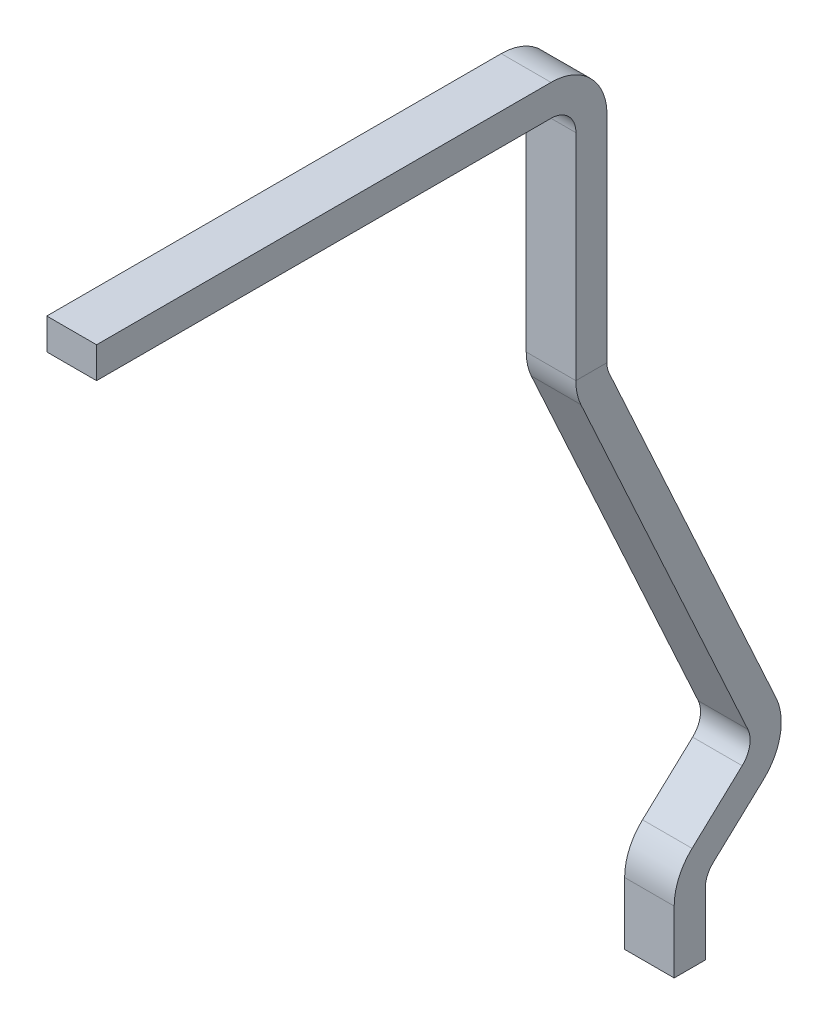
ISO-10303-21;
HEADER;
FILE_DESCRIPTION(('STEP AP214'),'2;1');
FILE_NAME('part.step','',(''),(''),'','','');
FILE_SCHEMA(('AUTOMOTIVE_DESIGN { 1 0 10303 214 1 1 1 1 }'));
ENDSEC;
DATA;
#1=APPLICATION_CONTEXT('core data for automotive mechanical design processes');
#2=APPLICATION_PROTOCOL_DEFINITION('international standard','automotive_design',2000,#1);
#3=PRODUCT_CONTEXT('',#1,'mechanical');
#4=PRODUCT('Part','Part','',(#3));
#5=PRODUCT_RELATED_PRODUCT_CATEGORY('part','',(#4));
#6=PRODUCT_DEFINITION_FORMATION('','',#4);
#7=PRODUCT_DEFINITION_CONTEXT('part definition',#1,'design');
#8=PRODUCT_DEFINITION('design','',#6,#7);
#9=PRODUCT_DEFINITION_SHAPE('','',#8);
#10=(LENGTH_UNIT() NAMED_UNIT(*) SI_UNIT(.MILLI.,.METRE.));
#11=(NAMED_UNIT(*) PLANE_ANGLE_UNIT() SI_UNIT($,.RADIAN.));
#12=(NAMED_UNIT(*) SI_UNIT($,.STERADIAN.) SOLID_ANGLE_UNIT());
#13=UNCERTAINTY_MEASURE_WITH_UNIT(LENGTH_MEASURE(1.E-05),#10,'distance_accuracy_value','');
#14=(GEOMETRIC_REPRESENTATION_CONTEXT(3) GLOBAL_UNCERTAINTY_ASSIGNED_CONTEXT((#13)) GLOBAL_UNIT_ASSIGNED_CONTEXT((#10,
#11,#12)) REPRESENTATION_CONTEXT('',''));
#15=CARTESIAN_POINT('',(0.,0.,0.));
#16=DIRECTION('',(0.,0.,1.));
#17=DIRECTION('',(1.,0.,0.));
#18=AXIS2_PLACEMENT_3D('',#15,#16,#17);
#19=CARTESIAN_POINT('',(0.20000000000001,-0.8625,-0.125));
#20=DIRECTION('',(1.,0.,0.));
#21=DIRECTION('',(0.,1.,0.));
#22=AXIS2_PLACEMENT_3D('',#19,#20,#21);
#23=PLANE('',#22);
#24=DIRECTION('',(0.,0.,1.));
#25=VECTOR('',#24,1.);
#26=CARTESIAN_POINT('',(0.2,1.0625,2.15));
#27=LINE('',#26,#25);
#28=CARTESIAN_POINT('',(0.200000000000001,1.06250000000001,0.325000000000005));
#29=VERTEX_POINT('',#28);
#30=CARTESIAN_POINT('',(0.2,1.0625,3.975));
#31=VERTEX_POINT('',#30);
#32=EDGE_CURVE('E223',#29,#31,#27,.T.);
#33=ORIENTED_EDGE('',*,*,#32,.F.);
#34=CARTESIAN_POINT('',(0.200000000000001,1.06250000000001,0.325));
#35=CARTESIAN_POINT('',(0.200000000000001,1.06183010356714,0.242036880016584));
#36=CARTESIAN_POINT('',(0.200000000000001,1.00392135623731,0.183578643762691));
#37=CARTESIAN_POINT('',(0.200000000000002,0.975421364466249,0.154808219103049));
#38=CARTESIAN_POINT('',(0.200000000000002,0.936118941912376,0.139042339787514));
#39=CARTESIAN_POINT('',(0.200000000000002,0.901906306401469,0.125318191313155));
#40=CARTESIAN_POINT('',(0.200000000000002,0.8625,0.125));
#41=B_SPLINE_CURVE_WITH_KNOTS('',2,(#34,#35,#36,#37,#38,#39,#40),.UNSPECIFIED.,.F.,.F.,(3,2,2,
3),(0.,0.5,0.75,1.),.UNSPECIFIED.);
#42=CARTESIAN_POINT('',(0.200000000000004,0.862499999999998,0.125000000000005));
#43=VERTEX_POINT('',#42);
#44=EDGE_CURVE('E232',#29,#43,#41,.T.);
#45=ORIENTED_EDGE('',*,*,#44,.T.);
#46=DIRECTION('',(0.,-1.,0.));
#47=VECTOR('',#46,1.);
#48=CARTESIAN_POINT('',(0.200000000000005,0.225,0.12500000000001));
#49=LINE('',#48,#47);
#50=CARTESIAN_POINT('',(0.199333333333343,-0.8625,0.125000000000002));
#51=VERTEX_POINT('',#50);
#52=EDGE_CURVE('E179',#43,#51,#49,.T.);
#53=ORIENTED_EDGE('',*,*,#52,.T.);
#54=CARTESIAN_POINT('',(0.20000000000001,-0.8625,0.125000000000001));
#55=DIRECTION('',(0.,0.,-1.));
#56=VECTOR('',#55,1.);
#57=LINE('',#54,#56);
#58=CARTESIAN_POINT('',(0.199333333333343,-0.8625,-0.125));
#59=VERTEX_POINT('',#58);
#60=EDGE_CURVE('E240',#51,#59,#57,.T.);
#61=ORIENTED_EDGE('',*,*,#60,.T.);
#62=DIRECTION('',(0.,-1.,0.));
#63=VECTOR('',#62,1.);
#64=CARTESIAN_POINT('',(0.20000000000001,0.,-0.125));
#65=LINE('',#64,#63);
#66=CARTESIAN_POINT('',(0.200000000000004,0.862499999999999,-0.125));
#67=VERTEX_POINT('',#66);
#68=EDGE_CURVE('E229',#67,#59,#65,.T.);
#69=ORIENTED_EDGE('',*,*,#68,.F.);
#70=CARTESIAN_POINT('',(0.200000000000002,0.8625,-0.125));
#71=CARTESIAN_POINT('',(0.200000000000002,0.904672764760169,-0.124659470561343));
#72=CARTESIAN_POINT('',(0.200000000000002,0.944383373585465,-0.117487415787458));
#73=CARTESIAN_POINT('',(0.200000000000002,0.985511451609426,-0.110059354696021));
#74=CARTESIAN_POINT('',(0.200000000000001,1.02814261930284,-0.0934047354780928));
#75=CARTESIAN_POINT('',(0.200000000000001,1.11301010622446,-0.0602497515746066));
#76=CARTESIAN_POINT('',(0.200000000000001,1.18069805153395,0.00680194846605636));
#77=CARTESIAN_POINT('',(0.2,1.24543150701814,0.070926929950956));
#78=CARTESIAN_POINT('',(0.2,1.28090473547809,0.159357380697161));
#79=CARTESIAN_POINT('',(0.2,1.3117840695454,0.236335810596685));
#80=CARTESIAN_POINT('',(0.2,1.3125,0.325));
#81=B_SPLINE_CURVE_WITH_KNOTS('',2,(#70,#71,#72,#73,#74,#75,#76,#77,#78,#79,#80),.UNSPECIFIED.,
.F.,.F.,(3,2,2,2,2,3),(0.,0.125,0.25,0.5,0.75,1.),.UNSPECIFIED.);
#82=CARTESIAN_POINT('',(0.200000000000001,1.3125,0.325000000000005));
#83=VERTEX_POINT('',#82);
#84=EDGE_CURVE('E281',#67,#83,#81,.T.);
#85=ORIENTED_EDGE('',*,*,#84,.T.);
#86=DIRECTION('',(0.,0.,-1.));
#87=VECTOR('',#86,1.);
#88=CARTESIAN_POINT('',(0.2,1.3125,2.15));
#89=LINE('',#88,#87);
#90=CARTESIAN_POINT('',(0.2,1.3125,3.975));
#91=VERTEX_POINT('',#90);
#92=EDGE_CURVE('E200',#91,#83,#89,.T.);
#93=ORIENTED_EDGE('',*,*,#92,.F.);
#94=DIRECTION('',(0.,1.,0.));
#95=VECTOR('',#94,1.);
#96=CARTESIAN_POINT('',(0.2,1.1875,3.975));
#97=LINE('',#96,#95);
#98=EDGE_CURVE('E216',#31,#91,#97,.T.);
#99=ORIENTED_EDGE('',*,*,#98,.F.);
#100=EDGE_LOOP('',(#33,#45,#53,#61,#69,#85,#93,#99));
#101=FACE_BOUND('',#100,.T.);
#102=ADVANCED_FACE('F17',(#101),#23,.T.);
#103=CARTESIAN_POINT('',(0.20000000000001,-0.8625,-0.125));
#104=DIRECTION('',(0.,0.,-1.));
#105=DIRECTION('',(-1.,0.,0.));
#106=AXIS2_PLACEMENT_3D('',#103,#104,#105);
#107=PLANE('',#106);
#108=DIRECTION('',(-1.,0.,0.));
#109=VECTOR('',#108,1.);
#110=CARTESIAN_POINT('',(0.,-0.8625,-0.125));
#111=LINE('',#110,#109);
#112=CARTESIAN_POINT('',(-0.19933333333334,-0.8625,-0.125));
#113=VERTEX_POINT('',#112);
#114=EDGE_CURVE('E226',#59,#113,#111,.T.);
#115=ORIENTED_EDGE('',*,*,#114,.T.);
#116=DIRECTION('',(0.,-1.,0.));
#117=VECTOR('',#116,1.);
#118=CARTESIAN_POINT('',(-0.2,0.225,-0.125));
#119=LINE('',#118,#117);
#120=CARTESIAN_POINT('',(-0.2,0.8625,-0.125));
#121=VERTEX_POINT('',#120);
#122=EDGE_CURVE('E220',#121,#113,#119,.T.);
#123=ORIENTED_EDGE('',*,*,#122,.F.);
#124=DIRECTION('',(-1.,0.,0.));
#125=VECTOR('',#124,1.);
#126=CARTESIAN_POINT('',(0.,0.8625,-0.125));
#127=LINE('',#126,#125);
#128=EDGE_CURVE('E192',#67,#121,#127,.T.);
#129=ORIENTED_EDGE('',*,*,#128,.F.);
#130=ORIENTED_EDGE('',*,*,#68,.T.);
#131=EDGE_LOOP('',(#115,#123,#129,#130));
#132=FACE_BOUND('',#131,.T.);
#133=ADVANCED_FACE('F266',(#132),#107,.T.);
#134=CARTESIAN_POINT('',(-0.2,1.0625,0.325));
#135=DIRECTION('',(0.,-1.,0.));
#136=DIRECTION('',(1.,0.,0.));
#137=AXIS2_PLACEMENT_3D('',#134,#135,#136);
#138=PLANE('',#137);
#139=DIRECTION('',(0.,0.,1.));
#140=VECTOR('',#139,1.);
#141=CARTESIAN_POINT('',(-0.2,1.06250000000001,1.925));
#142=LINE('',#141,#140);
#143=CARTESIAN_POINT('',(-0.2,1.06250000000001,0.325));
#144=VERTEX_POINT('',#143);
#145=CARTESIAN_POINT('',(-0.2,1.0625,3.975));
#146=VERTEX_POINT('',#145);
#147=EDGE_CURVE('E163',#144,#146,#142,.T.);
#148=ORIENTED_EDGE('',*,*,#147,.F.);
#149=DIRECTION('',(-1.,0.,0.));
#150=VECTOR('',#149,1.);
#151=CARTESIAN_POINT('',(0.,1.06250000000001,0.325));
#152=LINE('',#151,#150);
#153=EDGE_CURVE('E159',#29,#144,#152,.T.);
#154=ORIENTED_EDGE('',*,*,#153,.F.);
#155=ORIENTED_EDGE('',*,*,#32,.T.);
#156=DIRECTION('',(1.,0.,0.));
#157=VECTOR('',#156,1.);
#158=CARTESIAN_POINT('',(0.,1.0625,3.975));
#159=LINE('',#158,#157);
#160=EDGE_CURVE('E206',#146,#31,#159,.T.);
#161=ORIENTED_EDGE('',*,*,#160,.F.);
#162=EDGE_LOOP('',(#148,#154,#155,#161));
#163=FACE_BOUND('',#162,.T.);
#164=ADVANCED_FACE('F509',(#163),#138,.T.);
#165=CARTESIAN_POINT('',(-0.2,1.3125,3.975));
#166=DIRECTION('',(0.,0.,1.));
#167=DIRECTION('',(0.,-1.,0.));
#168=AXIS2_PLACEMENT_3D('',#165,#166,#167);
#169=PLANE('',#168);
#170=DIRECTION('',(0.,1.,0.));
#171=VECTOR('',#170,1.);
#172=CARTESIAN_POINT('',(-0.2,0.225,3.975));
#173=LINE('',#172,#171);
#174=CARTESIAN_POINT('',(-0.2,1.3125,3.975));
#175=VERTEX_POINT('',#174);
#176=EDGE_CURVE('E209',#146,#175,#173,.T.);
#177=ORIENTED_EDGE('',*,*,#176,.F.);
#178=ORIENTED_EDGE('',*,*,#160,.T.);
#179=ORIENTED_EDGE('',*,*,#98,.T.);
#180=DIRECTION('',(1.,0.,0.));
#181=VECTOR('',#180,1.);
#182=CARTESIAN_POINT('',(0.,1.3125,3.975));
#183=LINE('',#182,#181);
#184=EDGE_CURVE('E203',#175,#91,#183,.T.);
#185=ORIENTED_EDGE('',*,*,#184,.F.);
#186=EDGE_LOOP('',(#177,#178,#179,#185));
#187=FACE_BOUND('',#186,.T.);
#188=ADVANCED_FACE('F510',(#187),#169,.T.);
#189=CARTESIAN_POINT('',(0.2,1.3125,0.325));
#190=DIRECTION('',(0.,1.,0.));
#191=DIRECTION('',(-1.,0.,0.));
#192=AXIS2_PLACEMENT_3D('',#189,#190,#191);
#193=PLANE('',#192);
#194=ORIENTED_EDGE('',*,*,#92,.T.);
#195=DIRECTION('',(1.,0.,0.));
#196=VECTOR('',#195,1.);
#197=CARTESIAN_POINT('',(0.,1.3125,0.325));
#198=LINE('',#197,#196);
#199=CARTESIAN_POINT('',(-0.2,1.3125,0.325));
#200=VERTEX_POINT('',#199);
#201=EDGE_CURVE('E195',#200,#83,#198,.T.);
#202=ORIENTED_EDGE('',*,*,#201,.F.);
#203=DIRECTION('',(0.,0.,-1.));
#204=VECTOR('',#203,1.);
#205=CARTESIAN_POINT('',(-0.2,1.3125,1.925));
#206=LINE('',#205,#204);
#207=EDGE_CURVE('E183',#175,#200,#206,.T.);
#208=ORIENTED_EDGE('',*,*,#207,.F.);
#209=ORIENTED_EDGE('',*,*,#184,.T.);
#210=EDGE_LOOP('',(#194,#202,#208,#209));
#211=FACE_BOUND('',#210,.T.);
#212=ADVANCED_FACE('F307',(#211),#193,.T.);
#213=CARTESIAN_POINT('',(0.24,0.8625,0.325));
#214=DIRECTION('',(-1.,0.,0.));
#215=DIRECTION('',(0.,0.,1.));
#216=AXIS2_PLACEMENT_3D('',#213,#214,#215);
#217=CYLINDRICAL_SURFACE('',#216,0.45);
#218=ORIENTED_EDGE('',*,*,#84,.F.);
#219=ORIENTED_EDGE('',*,*,#128,.T.);
#220=CARTESIAN_POINT('',(-0.2,0.8625,0.325));
#221=DIRECTION('',(-1.,0.,0.));
#222=DIRECTION('',(0.,0.,1.));
#223=AXIS2_PLACEMENT_3D('',#220,#221,#222);
#224=CIRCLE('',#223,0.45);
#225=EDGE_CURVE('E180',#200,#121,#224,.T.);
#226=ORIENTED_EDGE('',*,*,#225,.F.);
#227=ORIENTED_EDGE('',*,*,#201,.T.);
#228=EDGE_LOOP('',(#218,#219,#226,#227));
#229=FACE_BOUND('',#228,.T.);
#230=ADVANCED_FACE('F297',(#229),#217,.T.);
#231=CARTESIAN_POINT('',(0.24,0.8625,0.325));
#232=DIRECTION('',(-1.,0.,0.));
#233=DIRECTION('',(0.,0.,1.));
#234=AXIS2_PLACEMENT_3D('',#231,#232,#233);
#235=CYLINDRICAL_SURFACE('',#234,0.200000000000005);
#236=CARTESIAN_POINT('',(-0.2,0.8625,0.325));
#237=DIRECTION('',(-1.,0.,0.));
#238=DIRECTION('',(0.,0.,1.));
#239=AXIS2_PLACEMENT_3D('',#236,#237,#238);
#240=CIRCLE('',#239,0.200000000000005);
#241=CARTESIAN_POINT('',(-0.200000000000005,0.8625,0.125));
#242=VERTEX_POINT('',#241);
#243=EDGE_CURVE('E21',#242,#144,#240,.F.);
#244=ORIENTED_EDGE('',*,*,#243,.F.);
#245=DIRECTION('',(-1.,0.,0.));
#246=VECTOR('',#245,1.);
#247=CARTESIAN_POINT('',(0.,0.8625,0.125));
#248=LINE('',#247,#246);
#249=EDGE_CURVE('E156',#43,#242,#248,.T.);
#250=ORIENTED_EDGE('',*,*,#249,.F.);
#251=ORIENTED_EDGE('',*,*,#44,.F.);
#252=ORIENTED_EDGE('',*,*,#153,.T.);
#253=EDGE_LOOP('',(#244,#250,#251,#252));
#254=FACE_BOUND('',#253,.T.);
#255=ADVANCED_FACE('F154',(#254),#235,.F.);
#256=CARTESIAN_POINT('',(-0.2,1.3125,-0.125));
#257=DIRECTION('',(-1.,0.,0.));
#258=DIRECTION('',(0.,-1.,0.));
#259=AXIS2_PLACEMENT_3D('',#256,#257,#258);
#260=PLANE('',#259);
#261=ORIENTED_EDGE('',*,*,#207,.T.);
#262=ORIENTED_EDGE('',*,*,#225,.T.);
#263=ORIENTED_EDGE('',*,*,#122,.T.);
#264=CARTESIAN_POINT('',(-0.2,-0.8625,-0.124999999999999));
#265=DIRECTION('',(0.,0.,1.));
#266=VECTOR('',#265,1.);
#267=LINE('',#264,#266);
#268=CARTESIAN_POINT('',(-0.19933333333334,-0.8625,0.125000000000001));
#269=VERTEX_POINT('',#268);
#270=EDGE_CURVE('E164',#113,#269,#267,.T.);
#271=ORIENTED_EDGE('',*,*,#270,.T.);
#272=DIRECTION('',(0.,-1.,0.));
#273=VECTOR('',#272,1.);
#274=CARTESIAN_POINT('',(-0.20000000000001,0.,0.125));
#275=LINE('',#274,#273);
#276=EDGE_CURVE('E167',#242,#269,#275,.T.);
#277=ORIENTED_EDGE('',*,*,#276,.F.);
#278=ORIENTED_EDGE('',*,*,#243,.T.);
#279=ORIENTED_EDGE('',*,*,#147,.T.);
#280=ORIENTED_EDGE('',*,*,#176,.T.);
#281=EDGE_LOOP('',(#261,#262,#263,#271,#277,#278,#279,#280));
#282=FACE_BOUND('',#281,.T.);
#283=ADVANCED_FACE('F169',(#282),#260,.T.);
#284=CARTESIAN_POINT('',(-0.20000000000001,-0.8625,0.125));
#285=DIRECTION('',(0.,0.,1.));
#286=DIRECTION('',(1.,0.,0.));
#287=AXIS2_PLACEMENT_3D('',#284,#285,#286);
#288=PLANE('',#287);
#289=DIRECTION('',(-1.,0.,0.));
#290=VECTOR('',#289,1.);
#291=CARTESIAN_POINT('',(0.,-0.8625,0.125));
#292=LINE('',#291,#290);
#293=EDGE_CURVE('E464',#51,#269,#292,.T.);
#294=ORIENTED_EDGE('',*,*,#293,.F.);
#295=ORIENTED_EDGE('',*,*,#52,.F.);
#296=ORIENTED_EDGE('',*,*,#249,.T.);
#297=ORIENTED_EDGE('',*,*,#276,.T.);
#298=EDGE_LOOP('',(#294,#295,#296,#297));
#299=FACE_BOUND('',#298,.T.);
#300=ADVANCED_FACE('F177',(#299),#288,.T.);
#301=CARTESIAN_POINT('',(-0.19900000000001,-0.8625,-1.5349));
#302=DIRECTION('',(-1.,0.,0.));
#303=DIRECTION('',(0.,-1.,0.));
#304=AXIS2_PLACEMENT_3D('',#301,#302,#303);
#305=PLANE('',#304);
#306=CARTESIAN_POINT('',(-0.199000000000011,-0.8625,-0.325000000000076));
#307=DIRECTION('',(1.,0.,0.));
#308=DIRECTION('',(0.,0.,-1.));
#309=AXIS2_PLACEMENT_3D('',#306,#307,#308);
#310=CIRCLE('',#309,0.45000000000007);
#311=CARTESIAN_POINT('',(-0.199000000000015,-1.04980458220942,0.0841662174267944));
#312=VERTEX_POINT('',#311);
#313=EDGE_CURVE('E461',#269,#312,#310,.T.);
#314=ORIENTED_EDGE('',*,*,#313,.F.);
#315=ORIENTED_EDGE('',*,*,#270,.F.);
#316=CARTESIAN_POINT('',(-0.199000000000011,-0.8625,-0.324999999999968));
#317=DIRECTION('',(1.,0.,0.));
#318=DIRECTION('',(0.,0.,-1.));
#319=AXIS2_PLACEMENT_3D('',#316,#317,#318);
#320=CIRCLE('',#319,0.199999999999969);
#321=CARTESIAN_POINT('',(-0.199000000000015,-0.945746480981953,-0.143148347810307));
#322=VERTEX_POINT('',#321);
#323=EDGE_CURVE('E465',#322,#113,#320,.F.);
#324=ORIENTED_EDGE('',*,*,#323,.F.);
#325=DIRECTION('',(0.,0.909258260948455,0.416232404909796));
#326=VECTOR('',#325,1.);
#327=CARTESIAN_POINT('',(-0.19900000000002,-2.41047094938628,-0.81365728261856));
#328=LINE('',#327,#326);
#329=CARTESIAN_POINT('',(-0.199000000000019,-3.87519541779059,-1.48416621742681));
#330=VERTEX_POINT('',#329);
#331=EDGE_CURVE('E445',#330,#322,#328,.T.);
#332=ORIENTED_EDGE('',*,*,#331,.F.);
#333=CARTESIAN_POINT('',(-0.199000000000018,-4.06250000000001,-1.075));
#334=DIRECTION('',(-1.,0.,0.));
#335=DIRECTION('',(0.,0.,1.));
#336=AXIS2_PLACEMENT_3D('',#333,#334,#335);
#337=CIRCLE('',#336,0.45);
#338=CARTESIAN_POINT('',(-0.199000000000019,-4.39220548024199,-1.38125854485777));
#339=VERTEX_POINT('',#338);
#340=EDGE_CURVE('E442',#339,#330,#337,.F.);
#341=ORIENTED_EDGE('',*,*,#340,.F.);
#342=DIRECTION('',(0.,0.68057454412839,-0.732678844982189));
#343=VECTOR('',#342,1.);
#344=CARTESIAN_POINT('',(-0.19900000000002,-4.57908485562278,-1.18007181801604));
#345=LINE('',#344,#343);
#346=CARTESIAN_POINT('',(-0.199000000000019,-4.76596423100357,-0.978885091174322));
#347=VERTEX_POINT('',#346);
#348=EDGE_CURVE('E450',#347,#339,#345,.T.);
#349=ORIENTED_EDGE('',*,*,#348,.F.);
#350=CARTESIAN_POINT('',(-0.199000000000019,-4.9125,-1.115));
#351=DIRECTION('',(1.,0.,0.));
#352=DIRECTION('',(0.,0.,-1.));
#353=AXIS2_PLACEMENT_3D('',#350,#351,#352);
#354=CIRCLE('',#353,0.199999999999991);
#355=CARTESIAN_POINT('',(-0.199000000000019,-4.9125,-0.915000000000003));
#356=VERTEX_POINT('',#355);
#357=EDGE_CURVE('E447',#356,#347,#354,.F.);
#358=ORIENTED_EDGE('',*,*,#357,.F.);
#359=DIRECTION('',(0.,-1.,0.));
#360=VECTOR('',#359,1.);
#361=CARTESIAN_POINT('',(-0.199000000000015,-3.1375,-0.915000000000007));
#362=LINE('',#361,#360);
#363=CARTESIAN_POINT('',(-0.19900000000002,-5.4125,-0.915000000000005));
#364=VERTEX_POINT('',#363);
#365=EDGE_CURVE('E175',#356,#364,#362,.T.);
#366=ORIENTED_EDGE('',*,*,#365,.T.);
#367=DIRECTION('',(0.,0.,1.));
#368=VECTOR('',#367,1.);
#369=CARTESIAN_POINT('',(-0.19900000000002,-5.4125,-0.7));
#370=LINE('',#369,#368);
#371=CARTESIAN_POINT('',(-0.19900000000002,-5.4125,-0.665000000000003));
#372=VERTEX_POINT('',#371);
#373=EDGE_CURVE('E473',#364,#372,#370,.T.);
#374=ORIENTED_EDGE('',*,*,#373,.T.);
#375=DIRECTION('',(0.,1.,0.));
#376=VECTOR('',#375,1.);
#377=CARTESIAN_POINT('',(-0.199000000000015,-3.1375,-0.665000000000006));
#378=LINE('',#377,#376);
#379=CARTESIAN_POINT('',(-0.199000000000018,-4.9125,-0.665000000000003));
#380=VERTEX_POINT('',#379);
#381=EDGE_CURVE('E469',#372,#380,#378,.T.);
#382=ORIENTED_EDGE('',*,*,#381,.T.);
#383=CARTESIAN_POINT('',(-0.199000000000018,-4.9125,-1.11499999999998));
#384=DIRECTION('',(1.,0.,0.));
#385=DIRECTION('',(0.,0.,-1.));
#386=AXIS2_PLACEMENT_3D('',#383,#384,#385);
#387=CIRCLE('',#386,0.449999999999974);
#388=CARTESIAN_POINT('',(-0.199000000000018,-4.58279451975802,-0.808741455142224));
#389=VERTEX_POINT('',#388);
#390=EDGE_CURVE('E452',#389,#380,#387,.T.);
#391=ORIENTED_EDGE('',*,*,#390,.F.);
#392=DIRECTION('',(0.,-0.680574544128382,0.732678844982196));
#393=VECTOR('',#392,1.);
#394=CARTESIAN_POINT('',(-0.19900000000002,-4.39591514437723,-1.00992818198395));
#395=LINE('',#394,#393);
#396=CARTESIAN_POINT('',(-0.199000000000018,-4.20903576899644,-1.21111490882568));
#397=VERTEX_POINT('',#396);
#398=EDGE_CURVE('E488',#397,#389,#395,.T.);
#399=ORIENTED_EDGE('',*,*,#398,.F.);
#400=CARTESIAN_POINT('',(-0.199000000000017,-4.06249999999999,-1.075));
#401=DIRECTION('',(-1.,0.,0.));
#402=DIRECTION('',(0.,0.,1.));
#403=AXIS2_PLACEMENT_3D('',#400,#401,#402);
#404=CIRCLE('',#403,0.200000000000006);
#405=CARTESIAN_POINT('',(-0.199000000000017,-3.97925351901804,-1.25685165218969));
#406=VERTEX_POINT('',#405);
#407=EDGE_CURVE('E456',#406,#397,#404,.T.);
#408=ORIENTED_EDGE('',*,*,#407,.F.);
#409=DIRECTION('',(0.,-0.909258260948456,-0.416232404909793));
#410=VECTOR('',#409,1.);
#411=CARTESIAN_POINT('',(-0.19900000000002,-2.51452905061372,-0.586342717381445));
#412=LINE('',#411,#410);
#413=EDGE_CURVE('E491',#312,#406,#412,.T.);
#414=ORIENTED_EDGE('',*,*,#413,.F.);
#415=EDGE_LOOP('',(#314,#315,#324,#332,#341,#349,#358,#366,#374,#382,#391,#399,#408,#414));
#416=FACE_BOUND('',#415,.T.);
#417=ADVANCED_FACE('F339',(#416),#305,.T.);
#418=CARTESIAN_POINT('',(-0.238800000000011,-0.8625,-0.324999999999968));
#419=DIRECTION('',(1.,0.,0.));
#420=DIRECTION('',(0.,0.,-1.));
#421=AXIS2_PLACEMENT_3D('',#418,#419,#420);
#422=CYLINDRICAL_SURFACE('',#421,0.199999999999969);
#423=CARTESIAN_POINT('',(0.199000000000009,-0.8625,-0.324999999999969));
#424=DIRECTION('',(1.,0.,0.));
#425=DIRECTION('',(0.,0.,-1.));
#426=AXIS2_PLACEMENT_3D('',#423,#424,#425);
#427=CIRCLE('',#426,0.199999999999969);
#428=CARTESIAN_POINT('',(0.19900000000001,-0.945746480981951,-0.143148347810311));
#429=VERTEX_POINT('',#428);
#430=EDGE_CURVE('E435',#429,#59,#427,.F.);
#431=ORIENTED_EDGE('',*,*,#430,.F.);
#432=DIRECTION('',(1.,0.,0.));
#433=VECTOR('',#432,1.);
#434=CARTESIAN_POINT('',(0.,-0.94574648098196,-0.14314834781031));
#435=LINE('',#434,#433);
#436=EDGE_CURVE('E551',#322,#429,#435,.T.);
#437=ORIENTED_EDGE('',*,*,#436,.F.);
#438=ORIENTED_EDGE('',*,*,#323,.T.);
#439=ORIENTED_EDGE('',*,*,#114,.F.);
#440=EDGE_LOOP('',(#431,#437,#438,#439));
#441=FACE_BOUND('',#440,.T.);
#442=ADVANCED_FACE('F348',(#441),#422,.F.);
#443=CARTESIAN_POINT('',(-0.238800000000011,-0.8625,-0.325000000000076));
#444=DIRECTION('',(1.,0.,0.));
#445=DIRECTION('',(0.,0.,-1.));
#446=AXIS2_PLACEMENT_3D('',#443,#444,#445);
#447=CYLINDRICAL_SURFACE('',#446,0.45000000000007);
#448=CARTESIAN_POINT('',(0.19900000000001,-0.8625,-0.325000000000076));
#449=DIRECTION('',(1.,0.,0.));
#450=DIRECTION('',(0.,0.,-1.));
#451=AXIS2_PLACEMENT_3D('',#448,#449,#450);
#452=CIRCLE('',#451,0.45000000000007);
#453=CARTESIAN_POINT('',(0.199000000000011,-1.04980458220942,0.0841662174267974));
#454=VERTEX_POINT('',#453);
#455=EDGE_CURVE('E432',#51,#454,#452,.T.);
#456=ORIENTED_EDGE('',*,*,#455,.F.);
#457=ORIENTED_EDGE('',*,*,#293,.T.);
#458=ORIENTED_EDGE('',*,*,#313,.T.);
#459=DIRECTION('',(-1.,0.,0.));
#460=VECTOR('',#459,1.);
#461=CARTESIAN_POINT('',(0.,-1.04980458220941,0.0841662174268));
#462=LINE('',#461,#460);
#463=EDGE_CURVE('E460',#454,#312,#462,.T.);
#464=ORIENTED_EDGE('',*,*,#463,.F.);
#465=EDGE_LOOP('',(#456,#457,#458,#464));
#466=FACE_BOUND('',#465,.T.);
#467=ADVANCED_FACE('F351',(#466),#447,.T.);
#468=CARTESIAN_POINT('',(-0.19900000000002,-1.04980458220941,0.0841662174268));
#469=DIRECTION('',(0.,-0.416232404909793,0.909258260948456));
#470=DIRECTION('',(0.,-0.909258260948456,-0.416232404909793));
#471=AXIS2_PLACEMENT_3D('',#468,#469,#470);
#472=PLANE('',#471);
#473=DIRECTION('',(0.,-0.909258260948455,-0.416232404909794));
#474=VECTOR('',#473,1.);
#475=CARTESIAN_POINT('',(0.19900000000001,-1.04980458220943,0.0841662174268));
#476=LINE('',#475,#474);
#477=CARTESIAN_POINT('',(0.199000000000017,-3.97925351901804,-1.25685165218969));
#478=VERTEX_POINT('',#477);
#479=EDGE_CURVE('E429',#454,#478,#476,.T.);
#480=ORIENTED_EDGE('',*,*,#479,.F.);
#481=ORIENTED_EDGE('',*,*,#463,.T.);
#482=ORIENTED_EDGE('',*,*,#413,.T.);
#483=DIRECTION('',(-1.,0.,0.));
#484=VECTOR('',#483,1.);
#485=CARTESIAN_POINT('',(0.,-3.97925351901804,-1.2568516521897));
#486=LINE('',#485,#484);
#487=EDGE_CURVE('E459',#478,#406,#486,.T.);
#488=ORIENTED_EDGE('',*,*,#487,.F.);
#489=EDGE_LOOP('',(#480,#481,#482,#488));
#490=FACE_BOUND('',#489,.T.);
#491=ADVANCED_FACE('F355',(#490),#472,.T.);
#492=CARTESIAN_POINT('',(0.23880000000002,-4.06249999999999,-1.075));
#493=DIRECTION('',(-1.,0.,0.));
#494=DIRECTION('',(0.,0.,1.));
#495=AXIS2_PLACEMENT_3D('',#492,#493,#494);
#496=CYLINDRICAL_SURFACE('',#495,0.200000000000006);
#497=CARTESIAN_POINT('',(0.199000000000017,-4.06249999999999,-1.075));
#498=DIRECTION('',(-1.,0.,0.));
#499=DIRECTION('',(0.,0.,1.));
#500=AXIS2_PLACEMENT_3D('',#497,#498,#499);
#501=CIRCLE('',#500,0.200000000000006);
#502=CARTESIAN_POINT('',(0.199000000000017,-4.20903576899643,-1.21111490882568));
#503=VERTEX_POINT('',#502);
#504=EDGE_CURVE('E426',#478,#503,#501,.T.);
#505=ORIENTED_EDGE('',*,*,#504,.F.);
#506=ORIENTED_EDGE('',*,*,#487,.T.);
#507=ORIENTED_EDGE('',*,*,#407,.T.);
#508=DIRECTION('',(-1.,0.,0.));
#509=VECTOR('',#508,1.);
#510=CARTESIAN_POINT('',(0.,-4.20903576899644,-1.21111490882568));
#511=LINE('',#510,#509);
#512=EDGE_CURVE('E455',#503,#397,#511,.T.);
#513=ORIENTED_EDGE('',*,*,#512,.F.);
#514=EDGE_LOOP('',(#505,#506,#507,#513));
#515=FACE_BOUND('',#514,.T.);
#516=ADVANCED_FACE('F359',(#515),#496,.F.);
#517=CARTESIAN_POINT('',(-0.19900000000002,-4.20903576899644,-1.21111490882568));
#518=DIRECTION('',(0.,0.732678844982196,0.680574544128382));
#519=DIRECTION('',(0.,-0.680574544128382,0.732678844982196));
#520=AXIS2_PLACEMENT_3D('',#517,#518,#519);
#521=PLANE('',#520);
#522=DIRECTION('',(0.,-0.680574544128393,0.732678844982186));
#523=VECTOR('',#522,1.);
#524=CARTESIAN_POINT('',(0.199000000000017,-4.20903576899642,-1.21111490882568));
#525=LINE('',#524,#523);
#526=CARTESIAN_POINT('',(0.199000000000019,-4.58279451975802,-0.808741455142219));
#527=VERTEX_POINT('',#526);
#528=EDGE_CURVE('E423',#503,#527,#525,.T.);
#529=ORIENTED_EDGE('',*,*,#528,.F.);
#530=ORIENTED_EDGE('',*,*,#512,.T.);
#531=ORIENTED_EDGE('',*,*,#398,.T.);
#532=DIRECTION('',(-1.,0.,0.));
#533=VECTOR('',#532,1.);
#534=CARTESIAN_POINT('',(0.,-4.58279451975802,-0.80874145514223));
#535=LINE('',#534,#533);
#536=EDGE_CURVE('E451',#527,#389,#535,.T.);
#537=ORIENTED_EDGE('',*,*,#536,.F.);
#538=EDGE_LOOP('',(#529,#530,#531,#537));
#539=FACE_BOUND('',#538,.T.);
#540=ADVANCED_FACE('F363',(#539),#521,.T.);
#541=CARTESIAN_POINT('',(-0.23880000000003,-4.9125,-1.11499999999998));
#542=DIRECTION('',(1.,0.,0.));
#543=DIRECTION('',(0.,0.,-1.));
#544=AXIS2_PLACEMENT_3D('',#541,#542,#543);
#545=CYLINDRICAL_SURFACE('',#544,0.449999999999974);
#546=CARTESIAN_POINT('',(0.199000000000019,-4.9125,-1.11499999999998));
#547=DIRECTION('',(1.,0.,0.));
#548=DIRECTION('',(0.,0.,-1.));
#549=AXIS2_PLACEMENT_3D('',#546,#547,#548);
#550=CIRCLE('',#549,0.449999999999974);
#551=CARTESIAN_POINT('',(0.199000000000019,-4.9125,-0.665000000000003));
#552=VERTEX_POINT('',#551);
#553=EDGE_CURVE('E419',#527,#552,#550,.T.);
#554=ORIENTED_EDGE('',*,*,#553,.F.);
#555=ORIENTED_EDGE('',*,*,#536,.T.);
#556=ORIENTED_EDGE('',*,*,#390,.T.);
#557=DIRECTION('',(-1.,0.,0.));
#558=VECTOR('',#557,1.);
#559=CARTESIAN_POINT('',(0.,-4.9125,-0.665));
#560=LINE('',#559,#558);
#561=EDGE_CURVE('E530',#552,#380,#560,.T.);
#562=ORIENTED_EDGE('',*,*,#561,.F.);
#563=EDGE_LOOP('',(#554,#555,#556,#562));
#564=FACE_BOUND('',#563,.T.);
#565=ADVANCED_FACE('F367',(#564),#545,.T.);
#566=CARTESIAN_POINT('',(-0.23880000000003,-4.9125,-1.115));
#567=DIRECTION('',(1.,0.,0.));
#568=DIRECTION('',(0.,0.,-1.));
#569=AXIS2_PLACEMENT_3D('',#566,#567,#568);
#570=CYLINDRICAL_SURFACE('',#569,0.199999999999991);
#571=CARTESIAN_POINT('',(0.199000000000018,-4.9125,-1.115));
#572=DIRECTION('',(1.,0.,0.));
#573=DIRECTION('',(0.,0.,-1.));
#574=AXIS2_PLACEMENT_3D('',#571,#572,#573);
#575=CIRCLE('',#574,0.199999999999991);
#576=CARTESIAN_POINT('',(0.199000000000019,-4.9125,-0.915000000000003));
#577=VERTEX_POINT('',#576);
#578=CARTESIAN_POINT('',(0.199000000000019,-4.76596423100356,-0.978885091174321));
#579=VERTEX_POINT('',#578);
#580=EDGE_CURVE('E416',#577,#579,#575,.F.);
#581=ORIENTED_EDGE('',*,*,#580,.F.);
#582=DIRECTION('',(1.,0.,0.));
#583=VECTOR('',#582,1.);
#584=CARTESIAN_POINT('',(0.,-4.9125,-0.915));
#585=LINE('',#584,#583);
#586=EDGE_CURVE('E439',#356,#577,#585,.T.);
#587=ORIENTED_EDGE('',*,*,#586,.F.);
#588=ORIENTED_EDGE('',*,*,#357,.T.);
#589=DIRECTION('',(-1.,0.,0.));
#590=VECTOR('',#589,1.);
#591=CARTESIAN_POINT('',(0.,-4.76596423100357,-0.97888509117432));
#592=LINE('',#591,#590);
#593=EDGE_CURVE('E487',#579,#347,#592,.T.);
#594=ORIENTED_EDGE('',*,*,#593,.F.);
#595=EDGE_LOOP('',(#581,#587,#588,#594));
#596=FACE_BOUND('',#595,.T.);
#597=ADVANCED_FACE('F371',(#596),#570,.F.);
#598=CARTESIAN_POINT('',(-0.19900000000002,-4.76596423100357,-0.97888509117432));
#599=DIRECTION('',(0.,-0.732678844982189,-0.68057454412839));
#600=DIRECTION('',(0.,0.68057454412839,-0.732678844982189));
#601=AXIS2_PLACEMENT_3D('',#598,#599,#600);
#602=PLANE('',#601);
#603=DIRECTION('',(0.,0.680574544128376,-0.732678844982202));
#604=VECTOR('',#603,1.);
#605=CARTESIAN_POINT('',(0.199000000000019,-4.76596423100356,-0.978885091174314));
#606=LINE('',#605,#604);
#607=CARTESIAN_POINT('',(0.199000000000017,-4.39220548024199,-1.38125854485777));
#608=VERTEX_POINT('',#607);
#609=EDGE_CURVE('E413',#579,#608,#606,.T.);
#610=ORIENTED_EDGE('',*,*,#609,.F.);
#611=ORIENTED_EDGE('',*,*,#593,.T.);
#612=ORIENTED_EDGE('',*,*,#348,.T.);
#613=DIRECTION('',(-1.,0.,0.));
#614=VECTOR('',#613,1.);
#615=CARTESIAN_POINT('',(0.,-4.39220548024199,-1.38125854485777));
#616=LINE('',#615,#614);
#617=EDGE_CURVE('E446',#608,#339,#616,.T.);
#618=ORIENTED_EDGE('',*,*,#617,.F.);
#619=EDGE_LOOP('',(#610,#611,#612,#618));
#620=FACE_BOUND('',#619,.T.);
#621=ADVANCED_FACE('F375',(#620),#602,.T.);
#622=CARTESIAN_POINT('',(0.23880000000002,-4.06250000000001,-1.075));
#623=DIRECTION('',(-1.,0.,0.));
#624=DIRECTION('',(0.,0.,1.));
#625=AXIS2_PLACEMENT_3D('',#622,#623,#624);
#626=CYLINDRICAL_SURFACE('',#625,0.45);
#627=DIRECTION('',(-1.,0.,0.));
#628=VECTOR('',#627,1.);
#629=CARTESIAN_POINT('',(0.,-3.87519541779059,-1.48416621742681));
#630=LINE('',#629,#628);
#631=CARTESIAN_POINT('',(0.199000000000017,-3.8751954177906,-1.48416621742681));
#632=VERTEX_POINT('',#631);
#633=EDGE_CURVE('E532',#632,#330,#630,.T.);
#634=ORIENTED_EDGE('',*,*,#633,.F.);
#635=CARTESIAN_POINT('',(0.199000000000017,-4.06250000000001,-1.075));
#636=DIRECTION('',(-1.,0.,0.));
#637=DIRECTION('',(0.,0.,1.));
#638=AXIS2_PLACEMENT_3D('',#635,#636,#637);
#639=CIRCLE('',#638,0.45);
#640=EDGE_CURVE('E410',#608,#632,#639,.F.);
#641=ORIENTED_EDGE('',*,*,#640,.F.);
#642=ORIENTED_EDGE('',*,*,#617,.T.);
#643=ORIENTED_EDGE('',*,*,#340,.T.);
#644=EDGE_LOOP('',(#634,#641,#642,#643));
#645=FACE_BOUND('',#644,.T.);
#646=ADVANCED_FACE('F379',(#645),#626,.T.);
#647=CARTESIAN_POINT('',(-0.19900000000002,-3.87519541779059,-1.48416621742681));
#648=DIRECTION('',(0.,0.416232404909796,-0.909258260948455));
#649=DIRECTION('',(0.,0.909258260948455,0.416232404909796));
#650=AXIS2_PLACEMENT_3D('',#647,#648,#649);
#651=PLANE('',#650);
#652=DIRECTION('',(0.,0.909258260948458,0.416232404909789));
#653=VECTOR('',#652,1.);
#654=CARTESIAN_POINT('',(0.199000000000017,-3.8751954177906,-1.4841662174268));
#655=LINE('',#654,#653);
#656=EDGE_CURVE('E401',#632,#429,#655,.T.);
#657=ORIENTED_EDGE('',*,*,#656,.F.);
#658=ORIENTED_EDGE('',*,*,#633,.T.);
#659=ORIENTED_EDGE('',*,*,#331,.T.);
#660=ORIENTED_EDGE('',*,*,#436,.T.);
#661=EDGE_LOOP('',(#657,#658,#659,#660));
#662=FACE_BOUND('',#661,.T.);
#663=ADVANCED_FACE('F383',(#662),#651,.T.);
#664=CARTESIAN_POINT('',(-0.19900000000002,-5.4125,-0.665));
#665=DIRECTION('',(0.,0.,1.));
#666=DIRECTION('',(1.,0.,0.));
#667=AXIS2_PLACEMENT_3D('',#664,#665,#666);
#668=PLANE('',#667);
#669=DIRECTION('',(0.,-1.,0.));
#670=VECTOR('',#669,1.);
#671=CARTESIAN_POINT('',(0.199000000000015,-3.1375,-0.665000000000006));
#672=LINE('',#671,#670);
#673=CARTESIAN_POINT('',(0.19900000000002,-5.4125,-0.665000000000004));
#674=VERTEX_POINT('',#673);
#675=EDGE_CURVE('E422',#552,#674,#672,.T.);
#676=ORIENTED_EDGE('',*,*,#675,.F.);
#677=ORIENTED_EDGE('',*,*,#561,.T.);
#678=ORIENTED_EDGE('',*,*,#381,.F.);
#679=DIRECTION('',(-1.,0.,0.));
#680=VECTOR('',#679,1.);
#681=CARTESIAN_POINT('',(0.,-5.4125,-0.665));
#682=LINE('',#681,#680);
#683=EDGE_CURVE('E409',#674,#372,#682,.T.);
#684=ORIENTED_EDGE('',*,*,#683,.F.);
#685=EDGE_LOOP('',(#676,#677,#678,#684));
#686=FACE_BOUND('',#685,.T.);
#687=ADVANCED_FACE('F387',(#686),#668,.T.);
#688=CARTESIAN_POINT('',(0.19900000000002,-5.4125,-0.915));
#689=DIRECTION('',(0.,0.,-1.));
#690=DIRECTION('',(-1.,0.,0.));
#691=AXIS2_PLACEMENT_3D('',#688,#689,#690);
#692=PLANE('',#691);
#693=DIRECTION('',(0.,1.,0.));
#694=VECTOR('',#693,1.);
#695=CARTESIAN_POINT('',(0.199000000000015,-3.1375,-0.915000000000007));
#696=LINE('',#695,#694);
#697=CARTESIAN_POINT('',(0.19900000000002,-5.4125,-0.915000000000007));
#698=VERTEX_POINT('',#697);
#699=EDGE_CURVE('E36',#698,#577,#696,.T.);
#700=ORIENTED_EDGE('',*,*,#699,.F.);
#701=DIRECTION('',(1.,0.,0.));
#702=VECTOR('',#701,1.);
#703=CARTESIAN_POINT('',(0.,-5.4125,-0.915));
#704=LINE('',#703,#702);
#705=EDGE_CURVE('E27',#364,#698,#704,.T.);
#706=ORIENTED_EDGE('',*,*,#705,.F.);
#707=ORIENTED_EDGE('',*,*,#365,.F.);
#708=ORIENTED_EDGE('',*,*,#586,.T.);
#709=EDGE_LOOP('',(#700,#706,#707,#708));
#710=FACE_BOUND('',#709,.T.);
#711=ADVANCED_FACE('F391',(#710),#692,.T.);
#712=CARTESIAN_POINT('',(0.19900000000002,-5.4125,-1.5349));
#713=DIRECTION('',(1.,0.,0.));
#714=DIRECTION('',(0.,1.,0.));
#715=AXIS2_PLACEMENT_3D('',#712,#713,#714);
#716=PLANE('',#715);
#717=ORIENTED_EDGE('',*,*,#640,.T.);
#718=ORIENTED_EDGE('',*,*,#656,.T.);
#719=ORIENTED_EDGE('',*,*,#430,.T.);
#720=ORIENTED_EDGE('',*,*,#60,.F.);
#721=ORIENTED_EDGE('',*,*,#455,.T.);
#722=ORIENTED_EDGE('',*,*,#479,.T.);
#723=ORIENTED_EDGE('',*,*,#504,.T.);
#724=ORIENTED_EDGE('',*,*,#528,.T.);
#725=ORIENTED_EDGE('',*,*,#553,.T.);
#726=ORIENTED_EDGE('',*,*,#675,.T.);
#727=DIRECTION('',(0.,0.,1.));
#728=VECTOR('',#727,1.);
#729=CARTESIAN_POINT('',(0.19900000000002,-5.4125,-0.79));
#730=LINE('',#729,#728);
#731=EDGE_CURVE('E11',#698,#674,#730,.T.);
#732=ORIENTED_EDGE('',*,*,#731,.F.);
#733=ORIENTED_EDGE('',*,*,#699,.T.);
#734=ORIENTED_EDGE('',*,*,#580,.T.);
#735=ORIENTED_EDGE('',*,*,#609,.T.);
#736=EDGE_LOOP('',(#717,#718,#719,#720,#721,#722,#723,#724,#725,#726,#732,#733,#734,#735));
#737=FACE_BOUND('',#736,.T.);
#738=ADVANCED_FACE('F394',(#737),#716,.T.);
#739=CARTESIAN_POINT('',(-0.19900000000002,-5.4125,-0.665));
#740=DIRECTION('',(0.,-1.,0.));
#741=DIRECTION('',(0.,0.,-1.));
#742=AXIS2_PLACEMENT_3D('',#739,#740,#741);
#743=PLANE('',#742);
#744=ORIENTED_EDGE('',*,*,#705,.T.);
#745=ORIENTED_EDGE('',*,*,#731,.T.);
#746=ORIENTED_EDGE('',*,*,#683,.T.);
#747=ORIENTED_EDGE('',*,*,#373,.F.);
#748=EDGE_LOOP('',(#744,#745,#746,#747));
#749=FACE_BOUND('',#748,.T.);
#750=ADVANCED_FACE('F19',(#749),#743,.T.);
#751=CLOSED_SHELL('',(#102,#133,#164,#188,#212,#230,#255,#283,#300,#417,#442,#467,#491,#516,
#540,#565,#597,#621,#646,#663,#687,#711,#738,#750));
#752=MANIFOLD_SOLID_BREP('B1',#751);
#753=ADVANCED_BREP_SHAPE_REPRESENTATION('',(#18,#752),#14);
#754=SHAPE_DEFINITION_REPRESENTATION(#9,#753);
ENDSEC;
END-ISO-10303-21;
